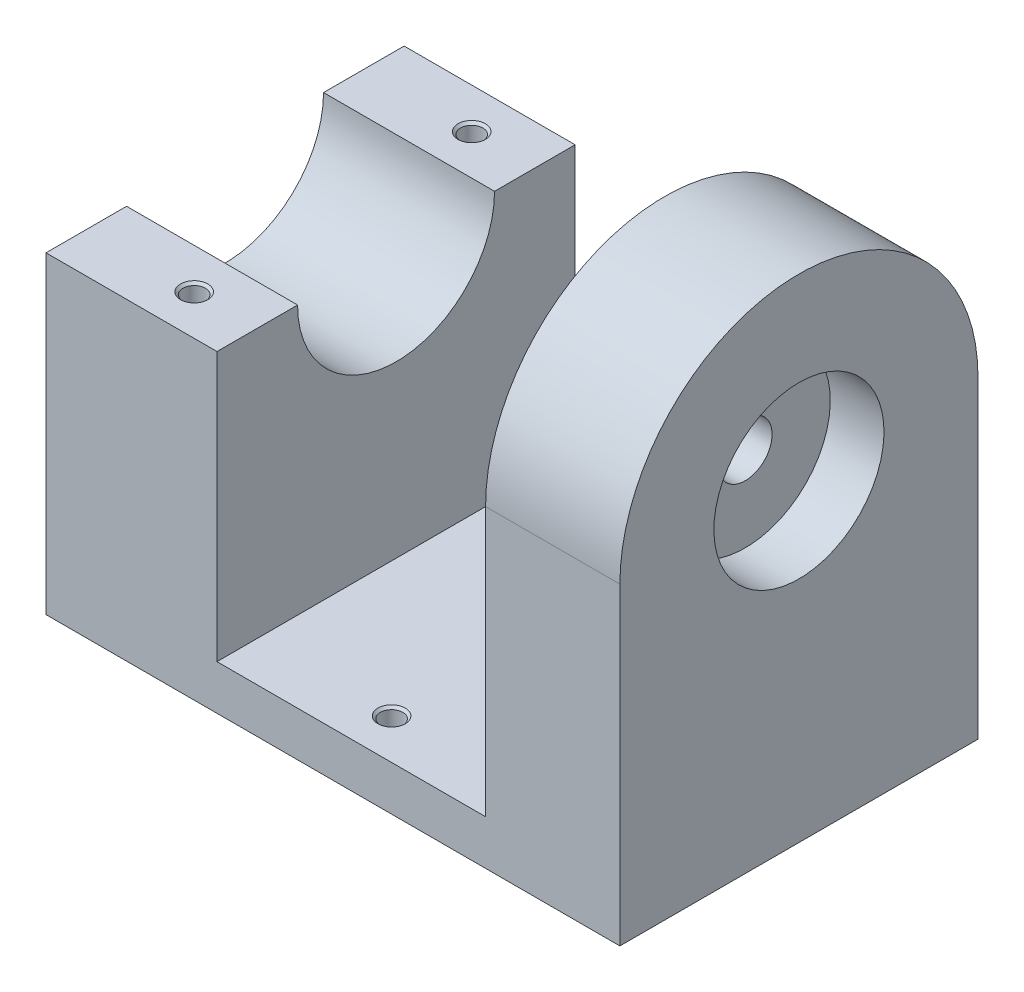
from build123d import *

# Parameters (mm, degrees)
EXTRUDE_1_DEPTH              = 40
SKETCH_3_R                   = 11
CUT_EXTRUDE_1_DEPTH          = 30
SKETCH_4_R                   = 20
EXTRUDE_2_DEPTH              = 15
SKETCH_5_R                   = 9.5
CUT_EXTRUDE_2_DEPTH          = 6
CUT_EXTRUDE_START            = -6
SKETCH_6_R                   = 9.5
CUT_EXTRUDE_3_DEPTH          = 6
SKETCH_7_R                   = 3
CUT_EXTRUDE_4_DEPTH          = 19
HOLE_WIZARD_M3_1_D           = 2.5
HOLE_WIZARD_M3_1_DEPTH       = 11.6
HOLE_WIZARD_M3_1_CSINK_D     = 3.05
HOLE_WIZARD_M3_1_CSINK_ANGLE = 90
HOLE_WIZARD_M3_1_TIP         = 0.751075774
HOLE_WIZARD_M3_2_D           = 2.5
HOLE_WIZARD_M3_2_DEPTH       = 6
HOLE_WIZARD_M3_2_CSINK_D     = 3.05
HOLE_WIZARD_M3_2_CSINK_ANGLE = 90
HOLE_WIZARD_M3_2_TIP         = 0.751075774


with BuildPart() as part:
    # Sketch 1 → Extrude 1 (new body)
    with BuildSketch(Plane.XY):
        Polygon((-32.05, 0), (32.05, 0), (32.05, 35), (17.05, 35), (17.05, 5), (-12.95, 5), (-12.95, 35), (-32.05, 35), align=None)
    extrude(amount=EXTRUDE_1_DEPTH)

    # Sketch 3 → Cut-Extrude 1 (cut)
    with BuildSketch(Plane.ZY.offset(32.05)):
        with Locations((20, 35)):
            Circle(SKETCH_3_R)
    extrude(amount=-CUT_EXTRUDE_1_DEPTH, mode=Mode.SUBTRACT)

    # Sketch 4 → Extrude 2 (add)
    with BuildSketch(Plane(origin=(32.05, 0, 0), x_dir=(0, 0, -1), z_dir=(1, 0, 0))):
        with Locations((-20, 35)):
            Circle(SKETCH_4_R)
    extrude(amount=-EXTRUDE_2_DEPTH)

    # Sketch 5 → Cut-Extrude 2 (cut)
    with BuildSketch(Plane.ZY.offset(-17.05)):
        with Locations(Location((20, 35, 0), (0, 0, 270))):
            Circle(SKETCH_5_R)
    extrude(amount=-CUT_EXTRUDE_2_DEPTH, mode=Mode.SUBTRACT)

    # Sketch 6 → Cut-Extrude 3 (cut)
    with BuildSketch(Plane(origin=(32.05, 0, 0), x_dir=(0, 0, -1), z_dir=(1, 0, 0)).offset(CUT_EXTRUDE_START)):
        with Locations(Location((-20, 35, 0), (0, 0, 270))):
            Circle(SKETCH_6_R)
    extrude(amount=CUT_EXTRUDE_3_DEPTH, mode=Mode.SUBTRACT)

    # Sketch 7 → Cut-Extrude 4 (cut)
    with BuildSketch(Plane.ZY.offset(-23.05)):
        with Locations(Location((20, 35, 0), (0, 0, 270))):
            Circle(SKETCH_7_R)
    extrude(amount=-CUT_EXTRUDE_4_DEPTH, mode=Mode.SUBTRACT)

    # Hole Wizard M3 _1
    with Locations(Plane(origin=(0, 5, 0), x_dir=(1, 0, 0), z_dir=(0, 1, 0))):
        with Locations((2.05, -4.5), (2.05, -35.5)):
            CounterSinkHole(HOLE_WIZARD_M3_1_D / 2, HOLE_WIZARD_M3_1_CSINK_D / 2, depth=HOLE_WIZARD_M3_1_DEPTH, counter_sink_angle=HOLE_WIZARD_M3_1_CSINK_ANGLE)
            with Locations((0, 0, -(HOLE_WIZARD_M3_1_DEPTH + HOLE_WIZARD_M3_1_TIP / 2))):  # 118° drill point
                Cone(0, HOLE_WIZARD_M3_1_D / 2, HOLE_WIZARD_M3_1_TIP, mode=Mode.SUBTRACT)

    # Hole Wizard M3 _2
    with Locations(Plane(origin=(0, 35, 0), x_dir=(1, 0, 0), z_dir=(0, 1, 0))):
        with Locations((-20, -4.5), (-20, -35.5)):
            CounterSinkHole(HOLE_WIZARD_M3_2_D / 2, HOLE_WIZARD_M3_2_CSINK_D / 2, depth=HOLE_WIZARD_M3_2_DEPTH, counter_sink_angle=HOLE_WIZARD_M3_2_CSINK_ANGLE)
            with Locations((0, 0, -(HOLE_WIZARD_M3_2_DEPTH + HOLE_WIZARD_M3_2_TIP / 2))):  # 118° drill point
                Cone(0, HOLE_WIZARD_M3_2_D / 2, HOLE_WIZARD_M3_2_TIP, mode=Mode.SUBTRACT)


solid = part.part
